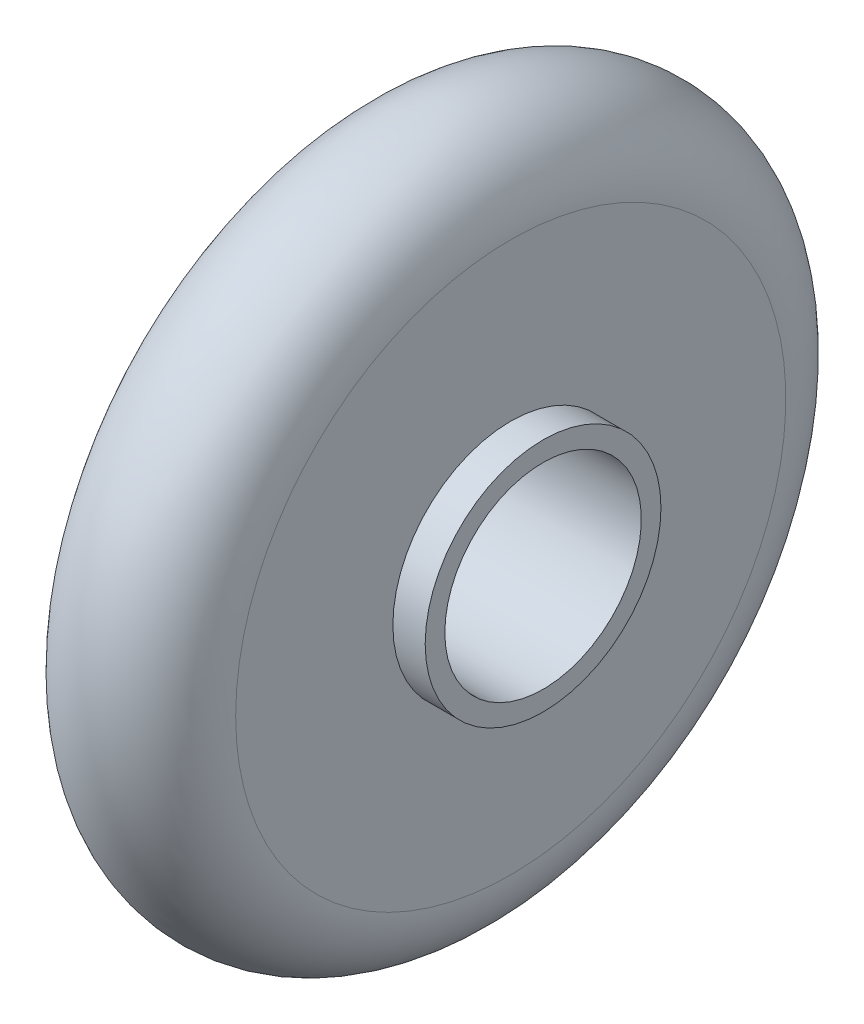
from build123d import *


with BuildPart() as part:
    # Esquisse1 → Base-R_volution (revolve)
    with BuildSketch(Plane.XY, mode=Mode.PRIVATE) as base_r_volution_sk:
        with BuildLine():
            Line((-62, 1), (-50.71, 1))
            Line((-50.71, 1), (-50.71, 2))
            Line((-50.71, 2), (-52.355, 2))
            Line((-52.355, 2), (-52.355, 10))
            ThreePointArc((-52.355, 10), (-56.355, 14), (-60.355, 10))
            Line((-60.355, 10), (-60.355, 2))
            Line((-60.355, 2), (-62, 2))
            Line((-62, 2), (-62, 1))
        make_face()
    revolve(base_r_volution_sk.sketch.rotate(Axis((-66, -4, 0), (1, 0, 0)), 90), axis=Axis((-66, -4, 0), (1, 0, 0)))


solid = part.part
